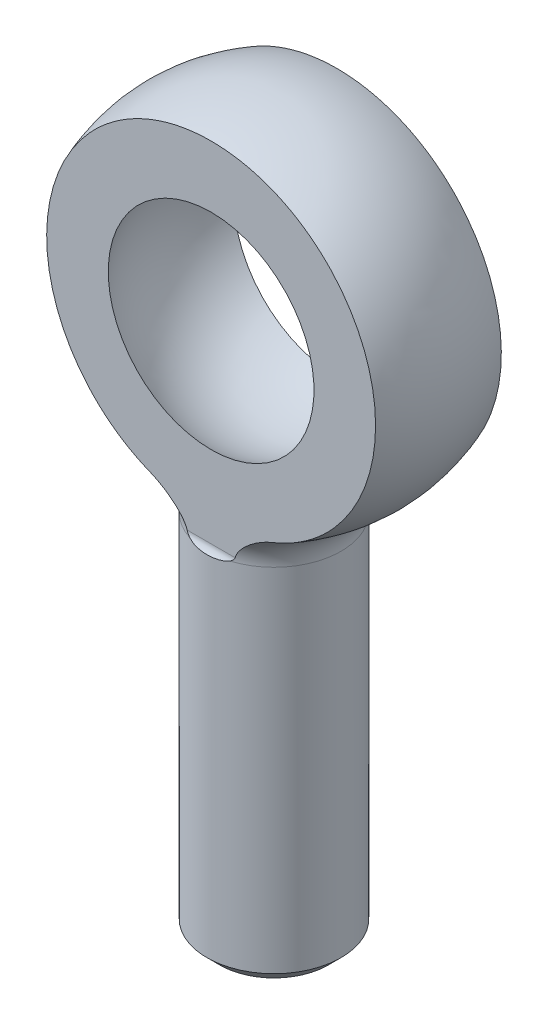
from build123d import *

# Parameters (mm, degrees)
ENL_V_MAT_EXTRU_1_DEPTH      = 73.374028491
ENL_V_MAT_EXTRU_1_DEPTH_BACK = 73.374028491
CHANFREIN1_SIZE              = 1.5


with BuildPart() as part:
    # Esquisse1 → Base-R_volution (revolve)
    with BuildSketch(Plane.XY, mode=Mode.PRIVATE) as base_r_volution_sk:
        with BuildLine():
            Line((0, -14.38), (0, -66))
            Line((0, -66), (-8, -66))
            Line((-8, -66), (-8, -22.516660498))
            ThreePointArc((-8, -22.516660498), (-8.669872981, -20.016660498), (-10.5, -18.186533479))
            ThreePointArc((-10.5, -18.186533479), (-20.284442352, 5.435199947), (0, 21))
            Line((0, 21), (0, 14.38))
            ThreePointArc((0, 14.38), (-14.38, 0), (0, -14.38))
        make_face()
    revolve(base_r_volution_sk.sketch.rotate(Axis((0, 87.100404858, 0), (0, -1, 0)), 180), axis=Axis((0, 87.100404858, 0), (0, -1, 0)))

    # Esquisse2 → Enl_v. mat.-Extru.1 (cut, two sides: drawn at the far end of the back side and taken through both)
    with BuildSketch(Plane(origin=(0, 0, 0), x_dir=(0, 0, -1), z_dir=(1, 0, 0)).offset(-ENL_V_MAT_EXTRU_1_DEPTH_BACK)):
        with BuildLine():
            Line((47.5, 40), (7.5, 40))
            Line((7.5, 40), (7.5, -22))
            ThreePointArc((7.5, -22), (7.792893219, -22.707106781), (8.5, -23))
            Line((8.5, -23), (47.5, -23))
            Line((47.5, -23), (47.5, 40))
        make_face()
        with BuildLine():
            Line((-7.5, 40), (-7.5, -22))
            ThreePointArc((-7.5, -22), (-7.792893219, -22.707106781), (-8.5, -23))
            Line((-8.5, -23), (-47.5, -23))
            Line((-47.5, -23), (-47.5, 40))
            Line((-47.5, 40), (-7.5, 40))
        make_face()
    extrude(amount=ENL_V_MAT_EXTRU_1_DEPTH + ENL_V_MAT_EXTRU_1_DEPTH_BACK, mode=Mode.SUBTRACT)

    # Chanfrein1
    chanfrein1_edges = [part.edges().sort_by_distance(p)[0] for p in [
        (-8, -66, 0),
    ]]
    chamfer(chanfrein1_edges, length=CHANFREIN1_SIZE)


solid = part.part
